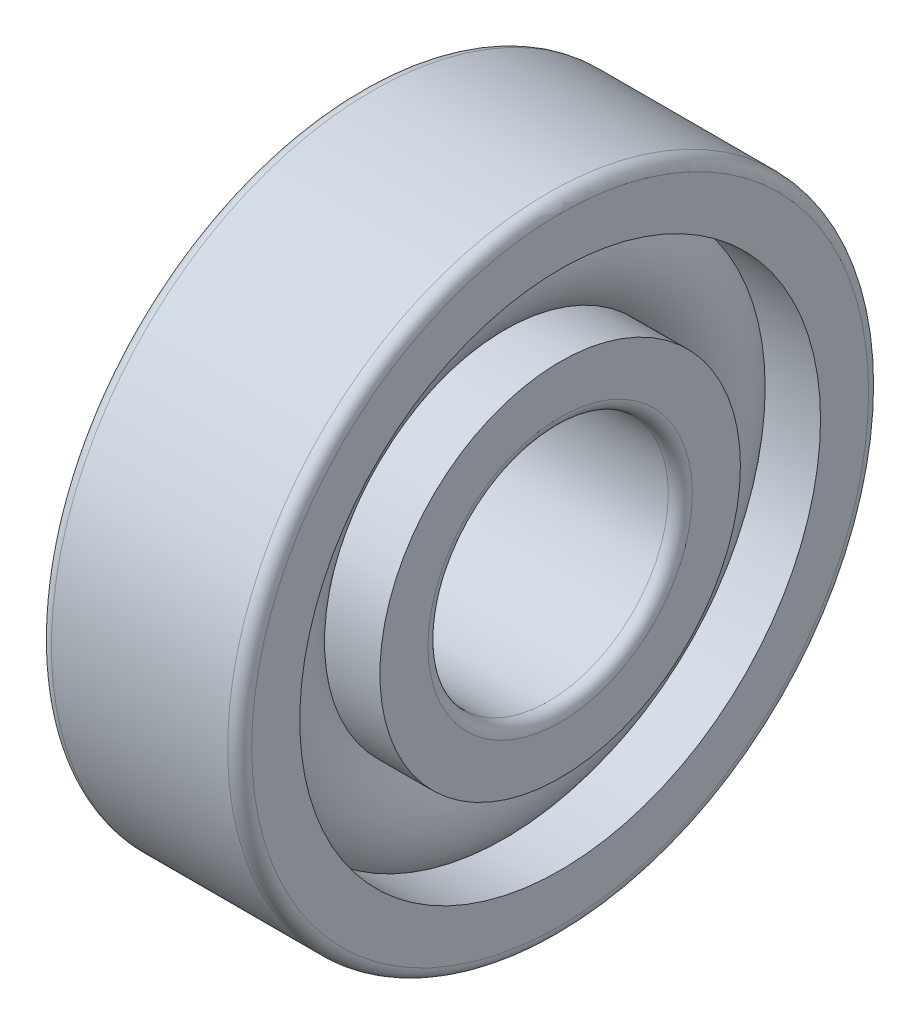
ISO-10303-21;
HEADER;
FILE_DESCRIPTION(('STEP AP214'),'2;1');
FILE_NAME('part.step','',(''),(''),'','','');
FILE_SCHEMA(('AUTOMOTIVE_DESIGN { 1 0 10303 214 1 1 1 1 }'));
ENDSEC;
DATA;
#1=APPLICATION_CONTEXT('core data for automotive mechanical design processes');
#2=APPLICATION_PROTOCOL_DEFINITION('international standard','automotive_design',2000,#1);
#3=PRODUCT_CONTEXT('',#1,'mechanical');
#4=PRODUCT('Part','Part','',(#3));
#5=PRODUCT_RELATED_PRODUCT_CATEGORY('part','',(#4));
#6=PRODUCT_DEFINITION_FORMATION('','',#4);
#7=PRODUCT_DEFINITION_CONTEXT('part definition',#1,'design');
#8=PRODUCT_DEFINITION('design','',#6,#7);
#9=PRODUCT_DEFINITION_SHAPE('','',#8);
#10=(LENGTH_UNIT() NAMED_UNIT(*) SI_UNIT(.MILLI.,.METRE.));
#11=(NAMED_UNIT(*) PLANE_ANGLE_UNIT() SI_UNIT($,.RADIAN.));
#12=(NAMED_UNIT(*) SI_UNIT($,.STERADIAN.) SOLID_ANGLE_UNIT());
#13=UNCERTAINTY_MEASURE_WITH_UNIT(LENGTH_MEASURE(1.E-05),#10,'distance_accuracy_value','');
#14=(GEOMETRIC_REPRESENTATION_CONTEXT(3) GLOBAL_UNCERTAINTY_ASSIGNED_CONTEXT((#13)) GLOBAL_UNIT_ASSIGNED_CONTEXT((#10,
#11,#12)) REPRESENTATION_CONTEXT('',''));
#15=CARTESIAN_POINT('',(0.,0.,0.));
#16=DIRECTION('',(0.,0.,1.));
#17=DIRECTION('',(1.,0.,0.));
#18=AXIS2_PLACEMENT_3D('',#15,#16,#17);
#19=CARTESIAN_POINT('',(0.,0.,0.));
#20=DIRECTION('',(-0.999999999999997,0.,0.));
#21=DIRECTION('',(0.,0.,1.));
#22=AXIS2_PLACEMENT_3D('',#19,#20,#21);
#23=TOROIDAL_SURFACE('',#22,11.,3.);
#24=CARTESIAN_POINT('',(2.23606797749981,0.,0.));
#25=DIRECTION('',(-0.999999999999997,0.,0.));
#26=DIRECTION('',(0.,0.,1.));
#27=AXIS2_PLACEMENT_3D('',#24,#25,#26);
#28=CIRCLE('',#27,13.);
#29=CARTESIAN_POINT('',(2.23606797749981,0.,-13.0000000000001));
#30=VERTEX_POINT('',#29);
#31=EDGE_CURVE('E38',#30,#30,#28,.F.);
#32=ORIENTED_EDGE('',*,*,#31,.T.);
#33=EDGE_LOOP('',(#32));
#34=FACE_BOUND('',#33,.T.);
#35=CARTESIAN_POINT('',(2.23606797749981,0.,0.));
#36=DIRECTION('',(-0.999999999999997,0.,0.));
#37=DIRECTION('',(0.,0.,1.));
#38=AXIS2_PLACEMENT_3D('',#35,#36,#37);
#39=CIRCLE('',#38,9.);
#40=CARTESIAN_POINT('',(2.23606797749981,0.,-9.00000000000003));
#41=VERTEX_POINT('',#40);
#42=EDGE_CURVE('E10',#41,#41,#39,.T.);
#43=ORIENTED_EDGE('',*,*,#42,.T.);
#44=EDGE_LOOP('',(#43));
#45=FACE_BOUND('',#44,.T.);
#46=ADVANCED_FACE('F34',(#34,#45),#23,.T.);
#47=CARTESIAN_POINT('',(-20.6375,0.,0.));
#48=DIRECTION('',(0.999999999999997,0.,0.));
#49=DIRECTION('',(0.,0.,-1.));
#50=AXIS2_PLACEMENT_3D('',#47,#48,#49);
#51=CYLINDRICAL_SURFACE('',#50,9.);
#52=CARTESIAN_POINT('',(5.,0.,0.));
#53=DIRECTION('',(0.999999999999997,0.,0.));
#54=DIRECTION('',(0.,0.,-1.));
#55=AXIS2_PLACEMENT_3D('',#52,#53,#54);
#56=CIRCLE('',#55,9.);
#57=CARTESIAN_POINT('',(5.,0.,-9.00000000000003));
#58=VERTEX_POINT('',#57);
#59=EDGE_CURVE('E51',#58,#58,#56,.T.);
#60=CARTESIAN_POINT('',(5.,0.,-9.00000000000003));
#61=CARTESIAN_POINT('',(4.97120904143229,0.,-9.00000000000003));
#62=CARTESIAN_POINT('',(4.94241808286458,0.,-9.00000000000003));
#63=CARTESIAN_POINT('',(4.88483616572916,0.,-9.00000000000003));
#64=CARTESIAN_POINT('',(4.85604520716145,0.,-9.00000000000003));
#65=CARTESIAN_POINT('',(4.79846329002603,0.,-9.00000000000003));
#66=CARTESIAN_POINT('',(4.76967233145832,0.,-9.00000000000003));
#67=CARTESIAN_POINT('',(4.7120904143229,0.,-9.00000000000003));
#68=CARTESIAN_POINT('',(4.68329945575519,0.,-9.00000000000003));
#69=CARTESIAN_POINT('',(4.62571753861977,0.,-9.00000000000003));
#70=CARTESIAN_POINT('',(4.59692658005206,0.,-9.00000000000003));
#71=CARTESIAN_POINT('',(4.53934466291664,0.,-9.00000000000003));
#72=CARTESIAN_POINT('',(4.51055370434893,0.,-9.00000000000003));
#73=CARTESIAN_POINT('',(4.45297178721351,0.,-9.00000000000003));
#74=CARTESIAN_POINT('',(4.4241808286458,0.,-9.00000000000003));
#75=CARTESIAN_POINT('',(4.36659891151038,0.,-9.00000000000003));
#76=CARTESIAN_POINT('',(4.33780795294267,0.,-9.00000000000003));
#77=CARTESIAN_POINT('',(4.28022603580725,0.,-9.00000000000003));
#78=CARTESIAN_POINT('',(4.25143507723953,0.,-9.00000000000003));
#79=CARTESIAN_POINT('',(4.19385316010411,0.,-9.00000000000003));
#80=CARTESIAN_POINT('',(4.1650622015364,0.,-9.00000000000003));
#81=CARTESIAN_POINT('',(4.10748028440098,0.,-9.00000000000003));
#82=CARTESIAN_POINT('',(4.07868932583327,0.,-9.00000000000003));
#83=CARTESIAN_POINT('',(4.02110740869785,0.,-9.00000000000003));
#84=CARTESIAN_POINT('',(3.99231645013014,0.,-9.00000000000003));
#85=CARTESIAN_POINT('',(3.93473453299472,0.,-9.00000000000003));
#86=CARTESIAN_POINT('',(3.90594357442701,0.,-9.00000000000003));
#87=CARTESIAN_POINT('',(3.84836165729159,0.,-9.00000000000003));
#88=CARTESIAN_POINT('',(3.81957069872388,0.,-9.00000000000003));
#89=CARTESIAN_POINT('',(3.76198878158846,0.,-9.00000000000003));
#90=CARTESIAN_POINT('',(3.73319782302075,0.,-9.00000000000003));
#91=CARTESIAN_POINT('',(3.67561590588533,0.,-9.00000000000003));
#92=CARTESIAN_POINT('',(3.64682494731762,0.,-9.00000000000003));
#93=CARTESIAN_POINT('',(3.5892430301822,0.,-9.00000000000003));
#94=CARTESIAN_POINT('',(3.56045207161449,0.,-9.00000000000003));
#95=CARTESIAN_POINT('',(3.50287015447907,0.,-9.00000000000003));
#96=CARTESIAN_POINT('',(3.47407919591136,0.,-9.00000000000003));
#97=CARTESIAN_POINT('',(3.41649727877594,0.,-9.00000000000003));
#98=CARTESIAN_POINT('',(3.38770632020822,0.,-9.00000000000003));
#99=CARTESIAN_POINT('',(3.3301244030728,0.,-9.00000000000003));
#100=CARTESIAN_POINT('',(3.30133344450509,0.,-9.00000000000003));
#101=CARTESIAN_POINT('',(3.24375152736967,0.,-9.00000000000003));
#102=CARTESIAN_POINT('',(3.21496056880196,0.,-9.00000000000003));
#103=CARTESIAN_POINT('',(3.15737865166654,0.,-9.00000000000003));
#104=CARTESIAN_POINT('',(3.12858769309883,0.,-9.00000000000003));
#105=CARTESIAN_POINT('',(3.07100577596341,0.,-9.00000000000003));
#106=CARTESIAN_POINT('',(3.0422148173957,0.,-9.00000000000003));
#107=CARTESIAN_POINT('',(2.98463290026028,0.,-9.00000000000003));
#108=CARTESIAN_POINT('',(2.95584194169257,0.,-9.00000000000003));
#109=CARTESIAN_POINT('',(2.89826002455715,0.,-9.00000000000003));
#110=CARTESIAN_POINT('',(2.86946906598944,0.,-9.00000000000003));
#111=CARTESIAN_POINT('',(2.81188714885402,0.,-9.00000000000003));
#112=CARTESIAN_POINT('',(2.78309619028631,0.,-9.00000000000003));
#113=CARTESIAN_POINT('',(2.72551427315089,0.,-9.00000000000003));
#114=CARTESIAN_POINT('',(2.69672331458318,0.,-9.00000000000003));
#115=CARTESIAN_POINT('',(2.63914139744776,0.,-9.00000000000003));
#116=CARTESIAN_POINT('',(2.61035043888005,0.,-9.00000000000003));
#117=CARTESIAN_POINT('',(2.55276852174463,0.,-9.00000000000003));
#118=CARTESIAN_POINT('',(2.52397756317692,0.,-9.00000000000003));
#119=CARTESIAN_POINT('',(2.4663956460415,0.,-9.00000000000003));
#120=CARTESIAN_POINT('',(2.43760468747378,0.,-9.00000000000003));
#121=CARTESIAN_POINT('',(2.38002277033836,0.,-9.00000000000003));
#122=CARTESIAN_POINT('',(2.35123181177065,0.,-9.00000000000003));
#123=CARTESIAN_POINT('',(2.29364989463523,0.,-9.00000000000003));
#124=CARTESIAN_POINT('',(2.26485893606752,0.,-9.00000000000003));
#125=CARTESIAN_POINT('',(2.23606797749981,0.,-9.00000000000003));
#126=B_SPLINE_CURVE_WITH_KNOTS('',3,(#60,#61,#62,#63,#64,#65,#66,#67,#68,#69,#70,#71,#72,#73,
#74,#75,#76,#77,#78,#79,#80,#81,#82,#83,#84,#85,#86,#87,#88,#89,#90,#91,#92,#93,#94,#95,#96,#97,
#98,#99,#100,#101,#102,#103,#104,#105,#106,#107,#108,#109,#110,#111,#112,#113,#114,#115,#116,
#117,#118,#119,#120,#121,#122,#123,#124,#125),.UNSPECIFIED.,.F.,.F.,(4,2,2,2,2,2,2,2,2,2,2,2,2,
2,2,2,2,2,2,2,2,2,2,2,2,2,2,2,2,2,2,2,4),(0.,0.0863728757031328,0.172745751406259,
0.259118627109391,0.345491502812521,0.431864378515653,0.518237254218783,0.604610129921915,
0.690983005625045,0.777355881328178,0.86372875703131,0.95010163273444,1.03647450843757,
1.1228473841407,1.20922025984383,1.29559313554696,1.38196601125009,1.46833888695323,
1.55471176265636,1.64108463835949,1.72745751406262,1.81383038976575,1.90020326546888,
1.98657614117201,2.07294901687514,2.15932189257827,2.2456947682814,2.33206764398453,
2.41844051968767,2.50481339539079,2.59118627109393,2.67755914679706,2.76393202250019),.UNSPECIFIED.);
#127=EDGE_CURVE('BSEAM100',#58,#41,#126,.T.);
#128=ORIENTED_EDGE('',*,*,#59,.F.);
#129=ORIENTED_EDGE('',*,*,#42,.F.);
#130=ORIENTED_EDGE('',*,*,#127,.T.);
#131=ORIENTED_EDGE('',*,*,#127,.F.);
#132=EDGE_LOOP('',(#128,#130,#129,#131));
#133=FACE_BOUND('',#132,.T.);
#134=ADVANCED_FACE('F100',(#133),#51,.T.);
#135=CARTESIAN_POINT('',(-20.6375,0.,0.));
#136=DIRECTION('',(0.999999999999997,0.,0.));
#137=DIRECTION('',(0.,0.,-1.));
#138=AXIS2_PLACEMENT_3D('',#135,#136,#137);
#139=CYLINDRICAL_SURFACE('',#138,9.);
#140=CARTESIAN_POINT('',(-5.,0.,0.));
#141=DIRECTION('',(0.999999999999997,0.,0.));
#142=DIRECTION('',(0.,0.,-1.));
#143=AXIS2_PLACEMENT_3D('',#140,#141,#142);
#144=CIRCLE('',#143,9.);
#145=CARTESIAN_POINT('',(-5.00000000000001,0.,-9.00000000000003));
#146=VERTEX_POINT('',#145);
#147=EDGE_CURVE('E64',#146,#146,#144,.T.);
#148=CARTESIAN_POINT('',(-2.23606797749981,0.,0.));
#149=DIRECTION('',(0.999999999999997,0.,0.));
#150=DIRECTION('',(0.,0.,-1.));
#151=AXIS2_PLACEMENT_3D('',#148,#149,#150);
#152=CIRCLE('',#151,9.);
#153=CARTESIAN_POINT('',(-2.23606797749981,0.,-9.00000000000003));
#154=VERTEX_POINT('',#153);
#155=EDGE_CURVE('E43',#154,#154,#152,.T.);
#156=CARTESIAN_POINT('',(-5.00000000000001,0.,-9.00000000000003));
#157=CARTESIAN_POINT('',(-4.9712090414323,0.,-9.00000000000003));
#158=CARTESIAN_POINT('',(-4.94241808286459,0.,-9.00000000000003));
#159=CARTESIAN_POINT('',(-4.88483616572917,0.,-9.00000000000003));
#160=CARTESIAN_POINT('',(-4.85604520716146,0.,-9.00000000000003));
#161=CARTESIAN_POINT('',(-4.79846329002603,0.,-9.00000000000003));
#162=CARTESIAN_POINT('',(-4.76967233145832,0.,-9.00000000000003));
#163=CARTESIAN_POINT('',(-4.7120904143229,0.,-9.00000000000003));
#164=CARTESIAN_POINT('',(-4.68329945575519,0.,-9.00000000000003));
#165=CARTESIAN_POINT('',(-4.62571753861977,0.,-9.00000000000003));
#166=CARTESIAN_POINT('',(-4.59692658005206,0.,-9.00000000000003));
#167=CARTESIAN_POINT('',(-4.53934466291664,0.,-9.00000000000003));
#168=CARTESIAN_POINT('',(-4.51055370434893,0.,-9.00000000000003));
#169=CARTESIAN_POINT('',(-4.45297178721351,0.,-9.00000000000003));
#170=CARTESIAN_POINT('',(-4.4241808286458,0.,-9.00000000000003));
#171=CARTESIAN_POINT('',(-4.36659891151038,0.,-9.00000000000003));
#172=CARTESIAN_POINT('',(-4.33780795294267,0.,-9.00000000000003));
#173=CARTESIAN_POINT('',(-4.28022603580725,0.,-9.00000000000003));
#174=CARTESIAN_POINT('',(-4.25143507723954,0.,-9.00000000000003));
#175=CARTESIAN_POINT('',(-4.19385316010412,0.,-9.00000000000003));
#176=CARTESIAN_POINT('',(-4.16506220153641,0.,-9.00000000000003));
#177=CARTESIAN_POINT('',(-4.10748028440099,0.,-9.00000000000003));
#178=CARTESIAN_POINT('',(-4.07868932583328,0.,-9.00000000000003));
#179=CARTESIAN_POINT('',(-4.02110740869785,0.,-9.00000000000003));
#180=CARTESIAN_POINT('',(-3.99231645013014,0.,-9.00000000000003));
#181=CARTESIAN_POINT('',(-3.93473453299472,0.,-9.00000000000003));
#182=CARTESIAN_POINT('',(-3.90594357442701,0.,-9.00000000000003));
#183=CARTESIAN_POINT('',(-3.84836165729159,0.,-9.00000000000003));
#184=CARTESIAN_POINT('',(-3.81957069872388,0.,-9.00000000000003));
#185=CARTESIAN_POINT('',(-3.76198878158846,0.,-9.00000000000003));
#186=CARTESIAN_POINT('',(-3.73319782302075,0.,-9.00000000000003));
#187=CARTESIAN_POINT('',(-3.67561590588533,0.,-9.00000000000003));
#188=CARTESIAN_POINT('',(-3.64682494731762,0.,-9.00000000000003));
#189=CARTESIAN_POINT('',(-3.5892430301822,0.,-9.00000000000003));
#190=CARTESIAN_POINT('',(-3.56045207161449,0.,-9.00000000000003));
#191=CARTESIAN_POINT('',(-3.50287015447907,0.,-9.00000000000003));
#192=CARTESIAN_POINT('',(-3.47407919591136,0.,-9.00000000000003));
#193=CARTESIAN_POINT('',(-3.41649727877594,0.,-9.00000000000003));
#194=CARTESIAN_POINT('',(-3.38770632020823,0.,-9.00000000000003));
#195=CARTESIAN_POINT('',(-3.33012440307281,0.,-9.00000000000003));
#196=CARTESIAN_POINT('',(-3.3013334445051,0.,-9.00000000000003));
#197=CARTESIAN_POINT('',(-3.24375152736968,0.,-9.00000000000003));
#198=CARTESIAN_POINT('',(-3.21496056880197,0.,-9.00000000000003));
#199=CARTESIAN_POINT('',(-3.15737865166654,0.,-9.00000000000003));
#200=CARTESIAN_POINT('',(-3.12858769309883,0.,-9.00000000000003));
#201=CARTESIAN_POINT('',(-3.07100577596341,0.,-9.00000000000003));
#202=CARTESIAN_POINT('',(-3.0422148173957,0.,-9.00000000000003));
#203=CARTESIAN_POINT('',(-2.98463290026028,0.,-9.00000000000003));
#204=CARTESIAN_POINT('',(-2.95584194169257,0.,-9.00000000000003));
#205=CARTESIAN_POINT('',(-2.89826002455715,0.,-9.00000000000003));
#206=CARTESIAN_POINT('',(-2.86946906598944,0.,-9.00000000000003));
#207=CARTESIAN_POINT('',(-2.81188714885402,0.,-9.00000000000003));
#208=CARTESIAN_POINT('',(-2.78309619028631,0.,-9.00000000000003));
#209=CARTESIAN_POINT('',(-2.72551427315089,0.,-9.00000000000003));
#210=CARTESIAN_POINT('',(-2.69672331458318,0.,-9.00000000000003));
#211=CARTESIAN_POINT('',(-2.63914139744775,0.,-9.00000000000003));
#212=CARTESIAN_POINT('',(-2.61035043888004,0.,-9.00000000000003));
#213=CARTESIAN_POINT('',(-2.55276852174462,0.,-9.00000000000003));
#214=CARTESIAN_POINT('',(-2.52397756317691,0.,-9.00000000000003));
#215=CARTESIAN_POINT('',(-2.46639564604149,0.,-9.00000000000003));
#216=CARTESIAN_POINT('',(-2.43760468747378,0.,-9.00000000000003));
#217=CARTESIAN_POINT('',(-2.38002277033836,0.,-9.00000000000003));
#218=CARTESIAN_POINT('',(-2.35123181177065,0.,-9.00000000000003));
#219=CARTESIAN_POINT('',(-2.29364989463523,0.,-9.00000000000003));
#220=CARTESIAN_POINT('',(-2.26485893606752,0.,-9.00000000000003));
#221=CARTESIAN_POINT('',(-2.23606797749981,0.,-9.00000000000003));
#222=B_SPLINE_CURVE_WITH_KNOTS('',3,(#156,#157,#158,#159,#160,#161,#162,#163,#164,#165,#166,
#167,#168,#169,#170,#171,#172,#173,#174,#175,#176,#177,#178,#179,#180,#181,#182,#183,#184,#185,
#186,#187,#188,#189,#190,#191,#192,#193,#194,#195,#196,#197,#198,#199,#200,#201,#202,#203,#204,
#205,#206,#207,#208,#209,#210,#211,#212,#213,#214,#215,#216,#217,#218,#219,#220,#221),
.UNSPECIFIED.,.F.,.F.,(4,2,2,2,2,2,2,2,2,2,2,2,2,2,2,2,2,2,2,2,2,2,2,2,2,2,2,2,2,2,2,2,4),(0.,
0.0863728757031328,0.172745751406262,0.259118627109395,0.345491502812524,0.431864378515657,
0.518237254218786,0.604610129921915,0.690983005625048,0.777355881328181,0.86372875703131,
0.950101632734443,1.03647450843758,1.12284738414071,1.20922025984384,1.29559313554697,
1.3819660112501,1.46833888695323,1.55471176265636,1.64108463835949,1.72745751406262,
1.81383038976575,1.90020326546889,1.98657614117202,2.07294901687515,2.15932189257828,
2.24569476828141,2.33206764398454,2.41844051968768,2.5048133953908,2.59118627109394,
2.67755914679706,2.7639320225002),.UNSPECIFIED.);
#223=EDGE_CURVE('BSEAM103',#146,#154,#222,.T.);
#224=ORIENTED_EDGE('',*,*,#147,.T.);
#225=ORIENTED_EDGE('',*,*,#155,.F.);
#226=ORIENTED_EDGE('',*,*,#223,.T.);
#227=ORIENTED_EDGE('',*,*,#223,.F.);
#228=EDGE_LOOP('',(#224,#226,#225,#227));
#229=FACE_BOUND('',#228,.T.);
#230=ADVANCED_FACE('F103',(#229),#139,.T.);
#231=CARTESIAN_POINT('',(5.,6.59999999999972,0.));
#232=DIRECTION('',(0.999999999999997,0.,0.));
#233=DIRECTION('',(0.,0.,-1.));
#234=AXIS2_PLACEMENT_3D('',#231,#232,#233);
#235=PLANE('',#234);
#236=ORIENTED_EDGE('',*,*,#59,.T.);
#237=EDGE_LOOP('',(#236));
#238=FACE_BOUND('',#237,.T.);
#239=CARTESIAN_POINT('',(5.,0.,0.));
#240=DIRECTION('',(0.999999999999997,0.,0.));
#241=DIRECTION('',(0.,0.,-1.));
#242=AXIS2_PLACEMENT_3D('',#239,#240,#241);
#243=CIRCLE('',#242,6.6);
#244=CARTESIAN_POINT('',(5.,0.,-6.60000000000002));
#245=VERTEX_POINT('',#244);
#246=EDGE_CURVE('E89',#245,#245,#243,.T.);
#247=ORIENTED_EDGE('',*,*,#246,.F.);
#248=EDGE_LOOP('',(#247));
#249=FACE_BOUND('',#248,.T.);
#250=ADVANCED_FACE('F97',(#238,#249),#235,.T.);
#251=CARTESIAN_POINT('',(4.40000000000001,0.,0.));
#252=DIRECTION('',(0.999999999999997,0.,0.));
#253=DIRECTION('',(0.,0.,-1.));
#254=AXIS2_PLACEMENT_3D('',#251,#252,#253);
#255=TOROIDAL_SURFACE('',#254,6.6,0.600000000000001);
#256=ORIENTED_EDGE('',*,*,#246,.T.);
#257=EDGE_LOOP('',(#256));
#258=FACE_BOUND('',#257,.T.);
#259=CARTESIAN_POINT('',(4.40000000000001,0.,0.));
#260=DIRECTION('',(0.999999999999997,0.,0.));
#261=DIRECTION('',(0.,0.,-1.));
#262=AXIS2_PLACEMENT_3D('',#259,#260,#261);
#263=CIRCLE('',#262,6.);
#264=CARTESIAN_POINT('',(4.40000000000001,0.,-6.00000000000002));
#265=VERTEX_POINT('',#264);
#266=EDGE_CURVE('E85',#265,#265,#263,.T.);
#267=ORIENTED_EDGE('',*,*,#266,.F.);
#268=EDGE_LOOP('',(#267));
#269=FACE_BOUND('',#268,.T.);
#270=ADVANCED_FACE('F114',(#258,#269),#255,.T.);
#271=CARTESIAN_POINT('',(-20.6375,0.,0.));
#272=DIRECTION('',(0.999999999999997,0.,0.));
#273=DIRECTION('',(0.,0.,-1.));
#274=AXIS2_PLACEMENT_3D('',#271,#272,#273);
#275=CYLINDRICAL_SURFACE('',#274,6.);
#276=CARTESIAN_POINT('',(-4.40000000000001,0.,0.));
#277=DIRECTION('',(0.999999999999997,0.,0.));
#278=DIRECTION('',(0.,0.,-1.));
#279=AXIS2_PLACEMENT_3D('',#276,#277,#278);
#280=CIRCLE('',#279,6.);
#281=CARTESIAN_POINT('',(-4.40000000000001,0.,-6.00000000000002));
#282=VERTEX_POINT('',#281);
#283=EDGE_CURVE('E82',#282,#282,#280,.T.);
#284=CARTESIAN_POINT('',(4.40000000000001,0.,-6.00000000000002));
#285=CARTESIAN_POINT('',(4.30833333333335,0.,-6.00000000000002));
#286=CARTESIAN_POINT('',(4.21666666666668,0.,-6.00000000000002));
#287=CARTESIAN_POINT('',(4.03333333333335,0.,-6.00000000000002));
#288=CARTESIAN_POINT('',(3.94166666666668,0.,-6.00000000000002));
#289=CARTESIAN_POINT('',(3.75833333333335,0.,-6.00000000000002));
#290=CARTESIAN_POINT('',(3.66666666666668,0.,-6.00000000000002));
#291=CARTESIAN_POINT('',(3.48333333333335,0.,-6.00000000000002));
#292=CARTESIAN_POINT('',(3.39166666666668,0.,-6.00000000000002));
#293=CARTESIAN_POINT('',(3.20833333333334,0.,-6.00000000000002));
#294=CARTESIAN_POINT('',(3.11666666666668,0.,-6.00000000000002));
#295=CARTESIAN_POINT('',(2.93333333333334,0.,-6.00000000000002));
#296=CARTESIAN_POINT('',(2.84166666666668,0.,-6.00000000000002));
#297=CARTESIAN_POINT('',(2.65833333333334,0.,-6.00000000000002));
#298=CARTESIAN_POINT('',(2.56666666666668,0.,-6.00000000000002));
#299=CARTESIAN_POINT('',(2.38333333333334,0.,-6.00000000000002));
#300=CARTESIAN_POINT('',(2.29166666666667,0.,-6.00000000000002));
#301=CARTESIAN_POINT('',(2.10833333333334,0.,-6.00000000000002));
#302=CARTESIAN_POINT('',(2.01666666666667,0.,-6.00000000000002));
#303=CARTESIAN_POINT('',(1.83333333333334,0.,-6.00000000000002));
#304=CARTESIAN_POINT('',(1.74166666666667,0.,-6.00000000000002));
#305=CARTESIAN_POINT('',(1.55833333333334,0.,-6.00000000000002));
#306=CARTESIAN_POINT('',(1.46666666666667,0.,-6.00000000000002));
#307=CARTESIAN_POINT('',(1.28333333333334,0.,-6.00000000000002));
#308=CARTESIAN_POINT('',(1.19166666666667,0.,-6.00000000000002));
#309=CARTESIAN_POINT('',(1.00833333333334,0.,-6.00000000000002));
#310=CARTESIAN_POINT('',(0.91666666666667,0.,-6.00000000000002));
#311=CARTESIAN_POINT('',(0.733333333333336,0.,-6.00000000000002));
#312=CARTESIAN_POINT('',(0.641666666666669,0.,-6.00000000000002));
#313=CARTESIAN_POINT('',(0.458333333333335,0.,-6.00000000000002));
#314=CARTESIAN_POINT('',(0.366666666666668,0.,-6.00000000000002));
#315=CARTESIAN_POINT('',(0.183333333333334,0.,-6.00000000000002));
#316=CARTESIAN_POINT('',(0.091666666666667,0.,-6.00000000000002));
#317=CARTESIAN_POINT('',(-0.091666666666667,0.,-6.00000000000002));
#318=CARTESIAN_POINT('',(-0.183333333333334,0.,-6.00000000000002));
#319=CARTESIAN_POINT('',(-0.366666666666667,0.,-6.00000000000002));
#320=CARTESIAN_POINT('',(-0.458333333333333,0.,-6.00000000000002));
#321=CARTESIAN_POINT('',(-0.641666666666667,0.,-6.00000000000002));
#322=CARTESIAN_POINT('',(-0.733333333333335,0.,-6.00000000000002));
#323=CARTESIAN_POINT('',(-0.91666666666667,0.,-6.00000000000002));
#324=CARTESIAN_POINT('',(-1.00833333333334,0.,-6.00000000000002));
#325=CARTESIAN_POINT('',(-1.19166666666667,0.,-6.00000000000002));
#326=CARTESIAN_POINT('',(-1.28333333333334,0.,-6.00000000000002));
#327=CARTESIAN_POINT('',(-1.46666666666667,0.,-6.00000000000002));
#328=CARTESIAN_POINT('',(-1.55833333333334,0.,-6.00000000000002));
#329=CARTESIAN_POINT('',(-1.74166666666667,0.,-6.00000000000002));
#330=CARTESIAN_POINT('',(-1.83333333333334,0.,-6.00000000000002));
#331=CARTESIAN_POINT('',(-2.01666666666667,0.,-6.00000000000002));
#332=CARTESIAN_POINT('',(-2.10833333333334,0.,-6.00000000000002));
#333=CARTESIAN_POINT('',(-2.29166666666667,0.,-6.00000000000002));
#334=CARTESIAN_POINT('',(-2.38333333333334,0.,-6.00000000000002));
#335=CARTESIAN_POINT('',(-2.56666666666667,0.,-6.00000000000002));
#336=CARTESIAN_POINT('',(-2.65833333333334,0.,-6.00000000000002));
#337=CARTESIAN_POINT('',(-2.84166666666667,0.,-6.00000000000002));
#338=CARTESIAN_POINT('',(-2.93333333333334,0.,-6.00000000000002));
#339=CARTESIAN_POINT('',(-3.11666666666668,0.,-6.00000000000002));
#340=CARTESIAN_POINT('',(-3.20833333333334,0.,-6.00000000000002));
#341=CARTESIAN_POINT('',(-3.39166666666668,0.,-6.00000000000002));
#342=CARTESIAN_POINT('',(-3.48333333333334,0.,-6.00000000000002));
#343=CARTESIAN_POINT('',(-3.66666666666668,0.,-6.00000000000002));
#344=CARTESIAN_POINT('',(-3.75833333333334,0.,-6.00000000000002));
#345=CARTESIAN_POINT('',(-3.94166666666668,0.,-6.00000000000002));
#346=CARTESIAN_POINT('',(-4.03333333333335,0.,-6.00000000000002));
#347=CARTESIAN_POINT('',(-4.21666666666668,0.,-6.00000000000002));
#348=CARTESIAN_POINT('',(-4.30833333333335,0.,-6.00000000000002));
#349=CARTESIAN_POINT('',(-4.40000000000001,0.,-6.00000000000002));
#350=B_SPLINE_CURVE_WITH_KNOTS('',3,(#284,#285,#286,#287,#288,#289,#290,#291,#292,#293,#294,
#295,#296,#297,#298,#299,#300,#301,#302,#303,#304,#305,#306,#307,#308,#309,#310,#311,#312,#313,
#314,#315,#316,#317,#318,#319,#320,#321,#322,#323,#324,#325,#326,#327,#328,#329,#330,#331,#332,
#333,#334,#335,#336,#337,#338,#339,#340,#341,#342,#343,#344,#345,#346,#347,#348,#349),
.UNSPECIFIED.,.F.,.F.,(4,2,2,2,2,2,2,2,2,2,2,2,2,2,2,2,2,2,2,2,2,2,2,2,2,2,2,2,2,2,2,2,4),(0.,
0.275000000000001,0.550000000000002,0.825000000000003,1.1,1.375,1.65000000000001,
1.92500000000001,2.20000000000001,2.47500000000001,2.75000000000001,3.02500000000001,
3.30000000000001,3.57500000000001,3.85000000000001,4.12500000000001,4.40000000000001,
4.67500000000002,4.95000000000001,5.22500000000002,5.50000000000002,5.77500000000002,
6.05000000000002,6.32500000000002,6.60000000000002,6.87500000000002,7.15000000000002,
7.42500000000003,7.70000000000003,7.97500000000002,8.25000000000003,8.52500000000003,
8.80000000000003),.UNSPECIFIED.);
#351=EDGE_CURVE('BSEAM117',#265,#282,#350,.T.);
#352=ORIENTED_EDGE('',*,*,#266,.T.);
#353=ORIENTED_EDGE('',*,*,#283,.F.);
#354=ORIENTED_EDGE('',*,*,#351,.T.);
#355=ORIENTED_EDGE('',*,*,#351,.F.);
#356=EDGE_LOOP('',(#352,#354,#353,#355));
#357=FACE_BOUND('',#356,.T.);
#358=ADVANCED_FACE('F117',(#357),#275,.F.);
#359=CARTESIAN_POINT('',(-4.40000000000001,0.,0.));
#360=DIRECTION('',(0.999999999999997,0.,0.));
#361=DIRECTION('',(0.,0.,-1.));
#362=AXIS2_PLACEMENT_3D('',#359,#360,#361);
#363=TOROIDAL_SURFACE('',#362,6.6,0.600000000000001);
#364=ORIENTED_EDGE('',*,*,#283,.T.);
#365=EDGE_LOOP('',(#364));
#366=FACE_BOUND('',#365,.T.);
#367=CARTESIAN_POINT('',(-5.,0.,0.));
#368=DIRECTION('',(0.999999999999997,0.,0.));
#369=DIRECTION('',(0.,0.,-1.));
#370=AXIS2_PLACEMENT_3D('',#367,#368,#369);
#371=CIRCLE('',#370,6.6);
#372=CARTESIAN_POINT('',(-5.,0.,-6.60000000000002));
#373=VERTEX_POINT('',#372);
#374=EDGE_CURVE('E78',#373,#373,#371,.T.);
#375=ORIENTED_EDGE('',*,*,#374,.F.);
#376=EDGE_LOOP('',(#375));
#377=FACE_BOUND('',#376,.T.);
#378=ADVANCED_FACE('F121',(#366,#377),#363,.T.);
#379=CARTESIAN_POINT('',(-4.99999999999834,8.99999999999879,-4.44089209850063E-13));
#380=DIRECTION('',(-0.999999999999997,0.,0.));
#381=DIRECTION('',(0.,0.,1.));
#382=AXIS2_PLACEMENT_3D('',#379,#380,#381);
#383=PLANE('',#382);
#384=ORIENTED_EDGE('',*,*,#374,.T.);
#385=EDGE_LOOP('',(#384));
#386=FACE_BOUND('',#385,.T.);
#387=ORIENTED_EDGE('',*,*,#147,.F.);
#388=EDGE_LOOP('',(#387));
#389=FACE_BOUND('',#388,.T.);
#390=ADVANCED_FACE('F125',(#386,#389),#383,.T.);
#391=CARTESIAN_POINT('',(-2.23606797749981,0.,0.));
#392=DIRECTION('',(0.999999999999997,0.,0.));
#393=DIRECTION('',(0.,0.,-1.));
#394=AXIS2_PLACEMENT_3D('',#391,#392,#393);
#395=CIRCLE('',#394,13.);
#396=CARTESIAN_POINT('',(-2.23606797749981,0.,-13.0000000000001));
#397=VERTEX_POINT('',#396);
#398=EDGE_CURVE('E54',#397,#397,#395,.F.);
#399=ORIENTED_EDGE('',*,*,#398,.T.);
#400=EDGE_LOOP('',(#399));
#401=FACE_BOUND('',#400,.T.);
#402=ORIENTED_EDGE('',*,*,#155,.T.);
#403=EDGE_LOOP('',(#402));
#404=FACE_BOUND('',#403,.T.);
#405=ADVANCED_FACE('F36',(#401,#404),#23,.T.);
#406=CARTESIAN_POINT('',(-20.6375,0.,0.));
#407=DIRECTION('',(0.999999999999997,0.,0.));
#408=DIRECTION('',(0.,0.,-1.));
#409=AXIS2_PLACEMENT_3D('',#406,#407,#408);
#410=CYLINDRICAL_SURFACE('',#409,13.);
#411=CARTESIAN_POINT('',(5.,0.,0.));
#412=DIRECTION('',(0.999999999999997,0.,0.));
#413=DIRECTION('',(0.,0.,-1.));
#414=AXIS2_PLACEMENT_3D('',#411,#412,#413);
#415=CIRCLE('',#414,13.);
#416=CARTESIAN_POINT('',(5.,0.,-13.0000000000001));
#417=VERTEX_POINT('',#416);
#418=EDGE_CURVE('E57',#417,#417,#415,.T.);
#419=CARTESIAN_POINT('',(5.,0.,-13.0000000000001));
#420=CARTESIAN_POINT('',(4.97120904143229,0.,-13.0000000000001));
#421=CARTESIAN_POINT('',(4.94241808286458,0.,-13.0000000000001));
#422=CARTESIAN_POINT('',(4.88483616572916,0.,-13.0000000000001));
#423=CARTESIAN_POINT('',(4.85604520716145,0.,-13.0000000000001));
#424=CARTESIAN_POINT('',(4.79846329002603,0.,-13.0000000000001));
#425=CARTESIAN_POINT('',(4.76967233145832,0.,-13.0000000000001));
#426=CARTESIAN_POINT('',(4.7120904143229,0.,-13.0000000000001));
#427=CARTESIAN_POINT('',(4.68329945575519,0.,-13.0000000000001));
#428=CARTESIAN_POINT('',(4.62571753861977,0.,-13.0000000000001));
#429=CARTESIAN_POINT('',(4.59692658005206,0.,-13.0000000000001));
#430=CARTESIAN_POINT('',(4.53934466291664,0.,-13.0000000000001));
#431=CARTESIAN_POINT('',(4.51055370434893,0.,-13.0000000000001));
#432=CARTESIAN_POINT('',(4.45297178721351,0.,-13.0000000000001));
#433=CARTESIAN_POINT('',(4.4241808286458,0.,-13.0000000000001));
#434=CARTESIAN_POINT('',(4.36659891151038,0.,-13.0000000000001));
#435=CARTESIAN_POINT('',(4.33780795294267,0.,-13.0000000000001));
#436=CARTESIAN_POINT('',(4.28022603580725,0.,-13.0000000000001));
#437=CARTESIAN_POINT('',(4.25143507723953,0.,-13.0000000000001));
#438=CARTESIAN_POINT('',(4.19385316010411,0.,-13.0000000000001));
#439=CARTESIAN_POINT('',(4.1650622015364,0.,-13.0000000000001));
#440=CARTESIAN_POINT('',(4.10748028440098,0.,-13.0000000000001));
#441=CARTESIAN_POINT('',(4.07868932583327,0.,-13.0000000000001));
#442=CARTESIAN_POINT('',(4.02110740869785,0.,-13.0000000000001));
#443=CARTESIAN_POINT('',(3.99231645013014,0.,-13.0000000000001));
#444=CARTESIAN_POINT('',(3.93473453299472,0.,-13.0000000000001));
#445=CARTESIAN_POINT('',(3.90594357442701,0.,-13.0000000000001));
#446=CARTESIAN_POINT('',(3.84836165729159,0.,-13.0000000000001));
#447=CARTESIAN_POINT('',(3.81957069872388,0.,-13.0000000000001));
#448=CARTESIAN_POINT('',(3.76198878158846,0.,-13.0000000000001));
#449=CARTESIAN_POINT('',(3.73319782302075,0.,-13.0000000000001));
#450=CARTESIAN_POINT('',(3.67561590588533,0.,-13.0000000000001));
#451=CARTESIAN_POINT('',(3.64682494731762,0.,-13.0000000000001));
#452=CARTESIAN_POINT('',(3.5892430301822,0.,-13.0000000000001));
#453=CARTESIAN_POINT('',(3.56045207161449,0.,-13.0000000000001));
#454=CARTESIAN_POINT('',(3.50287015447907,0.,-13.0000000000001));
#455=CARTESIAN_POINT('',(3.47407919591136,0.,-13.0000000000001));
#456=CARTESIAN_POINT('',(3.41649727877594,0.,-13.0000000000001));
#457=CARTESIAN_POINT('',(3.38770632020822,0.,-13.0000000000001));
#458=CARTESIAN_POINT('',(3.3301244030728,0.,-13.0000000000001));
#459=CARTESIAN_POINT('',(3.30133344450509,0.,-13.0000000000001));
#460=CARTESIAN_POINT('',(3.24375152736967,0.,-13.0000000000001));
#461=CARTESIAN_POINT('',(3.21496056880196,0.,-13.0000000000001));
#462=CARTESIAN_POINT('',(3.15737865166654,0.,-13.0000000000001));
#463=CARTESIAN_POINT('',(3.12858769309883,0.,-13.0000000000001));
#464=CARTESIAN_POINT('',(3.07100577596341,0.,-13.0000000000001));
#465=CARTESIAN_POINT('',(3.0422148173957,0.,-13.0000000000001));
#466=CARTESIAN_POINT('',(2.98463290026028,0.,-13.0000000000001));
#467=CARTESIAN_POINT('',(2.95584194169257,0.,-13.0000000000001));
#468=CARTESIAN_POINT('',(2.89826002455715,0.,-13.0000000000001));
#469=CARTESIAN_POINT('',(2.86946906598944,0.,-13.0000000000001));
#470=CARTESIAN_POINT('',(2.81188714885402,0.,-13.0000000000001));
#471=CARTESIAN_POINT('',(2.78309619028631,0.,-13.0000000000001));
#472=CARTESIAN_POINT('',(2.72551427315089,0.,-13.0000000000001));
#473=CARTESIAN_POINT('',(2.69672331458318,0.,-13.0000000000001));
#474=CARTESIAN_POINT('',(2.63914139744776,0.,-13.0000000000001));
#475=CARTESIAN_POINT('',(2.61035043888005,0.,-13.0000000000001));
#476=CARTESIAN_POINT('',(2.55276852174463,0.,-13.0000000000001));
#477=CARTESIAN_POINT('',(2.52397756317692,0.,-13.0000000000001));
#478=CARTESIAN_POINT('',(2.4663956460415,0.,-13.0000000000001));
#479=CARTESIAN_POINT('',(2.43760468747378,0.,-13.0000000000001));
#480=CARTESIAN_POINT('',(2.38002277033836,0.,-13.0000000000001));
#481=CARTESIAN_POINT('',(2.35123181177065,0.,-13.0000000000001));
#482=CARTESIAN_POINT('',(2.29364989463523,0.,-13.0000000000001));
#483=CARTESIAN_POINT('',(2.26485893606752,0.,-13.0000000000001));
#484=CARTESIAN_POINT('',(2.23606797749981,0.,-13.0000000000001));
#485=B_SPLINE_CURVE_WITH_KNOTS('',3,(#419,#420,#421,#422,#423,#424,#425,#426,#427,#428,#429,
#430,#431,#432,#433,#434,#435,#436,#437,#438,#439,#440,#441,#442,#443,#444,#445,#446,#447,#448,
#449,#450,#451,#452,#453,#454,#455,#456,#457,#458,#459,#460,#461,#462,#463,#464,#465,#466,#467,
#468,#469,#470,#471,#472,#473,#474,#475,#476,#477,#478,#479,#480,#481,#482,#483,#484),
.UNSPECIFIED.,.F.,.F.,(4,2,2,2,2,2,2,2,2,2,2,2,2,2,2,2,2,2,2,2,2,2,2,2,2,2,2,2,2,2,2,2,4),(0.,
0.0863728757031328,0.172745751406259,0.259118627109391,0.345491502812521,0.431864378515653,
0.518237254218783,0.604610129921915,0.690983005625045,0.777355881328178,0.86372875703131,
0.95010163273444,1.03647450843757,1.1228473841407,1.20922025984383,1.29559313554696,
1.38196601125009,1.46833888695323,1.55471176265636,1.64108463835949,1.72745751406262,
1.81383038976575,1.90020326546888,1.98657614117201,2.07294901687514,2.15932189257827,
2.2456947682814,2.33206764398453,2.41844051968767,2.50481339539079,2.59118627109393,
2.67755914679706,2.76393202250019),.UNSPECIFIED.);
#486=EDGE_CURVE('BSEAM130',#417,#30,#485,.T.);
#487=ORIENTED_EDGE('',*,*,#418,.T.);
#488=ORIENTED_EDGE('',*,*,#31,.F.);
#489=ORIENTED_EDGE('',*,*,#486,.T.);
#490=ORIENTED_EDGE('',*,*,#486,.F.);
#491=EDGE_LOOP('',(#487,#489,#488,#490));
#492=FACE_BOUND('',#491,.T.);
#493=ADVANCED_FACE('F130',(#492),#410,.F.);
#494=CARTESIAN_POINT('',(-20.6375,0.,0.));
#495=DIRECTION('',(0.999999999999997,0.,0.));
#496=DIRECTION('',(0.,0.,-1.));
#497=AXIS2_PLACEMENT_3D('',#494,#495,#496);
#498=CYLINDRICAL_SURFACE('',#497,13.);
#499=CARTESIAN_POINT('',(-5.,0.,0.));
#500=DIRECTION('',(0.999999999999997,0.,0.));
#501=DIRECTION('',(0.,0.,-1.));
#502=AXIS2_PLACEMENT_3D('',#499,#500,#501);
#503=CIRCLE('',#502,13.);
#504=CARTESIAN_POINT('',(-5.00000000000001,0.,-13.0000000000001));
#505=VERTEX_POINT('',#504);
#506=EDGE_CURVE('E161',#505,#505,#503,.T.);
#507=CARTESIAN_POINT('',(-5.00000000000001,0.,-13.0000000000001));
#508=CARTESIAN_POINT('',(-4.9712090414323,0.,-13.0000000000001));
#509=CARTESIAN_POINT('',(-4.94241808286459,0.,-13.0000000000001));
#510=CARTESIAN_POINT('',(-4.88483616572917,0.,-13.0000000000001));
#511=CARTESIAN_POINT('',(-4.85604520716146,0.,-13.0000000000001));
#512=CARTESIAN_POINT('',(-4.79846329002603,0.,-13.0000000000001));
#513=CARTESIAN_POINT('',(-4.76967233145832,0.,-13.0000000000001));
#514=CARTESIAN_POINT('',(-4.7120904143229,0.,-13.0000000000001));
#515=CARTESIAN_POINT('',(-4.68329945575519,0.,-13.0000000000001));
#516=CARTESIAN_POINT('',(-4.62571753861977,0.,-13.0000000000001));
#517=CARTESIAN_POINT('',(-4.59692658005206,0.,-13.0000000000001));
#518=CARTESIAN_POINT('',(-4.53934466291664,0.,-13.0000000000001));
#519=CARTESIAN_POINT('',(-4.51055370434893,0.,-13.0000000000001));
#520=CARTESIAN_POINT('',(-4.45297178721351,0.,-13.0000000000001));
#521=CARTESIAN_POINT('',(-4.4241808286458,0.,-13.0000000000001));
#522=CARTESIAN_POINT('',(-4.36659891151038,0.,-13.0000000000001));
#523=CARTESIAN_POINT('',(-4.33780795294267,0.,-13.0000000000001));
#524=CARTESIAN_POINT('',(-4.28022603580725,0.,-13.0000000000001));
#525=CARTESIAN_POINT('',(-4.25143507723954,0.,-13.0000000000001));
#526=CARTESIAN_POINT('',(-4.19385316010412,0.,-13.0000000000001));
#527=CARTESIAN_POINT('',(-4.16506220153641,0.,-13.0000000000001));
#528=CARTESIAN_POINT('',(-4.10748028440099,0.,-13.0000000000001));
#529=CARTESIAN_POINT('',(-4.07868932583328,0.,-13.0000000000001));
#530=CARTESIAN_POINT('',(-4.02110740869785,0.,-13.0000000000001));
#531=CARTESIAN_POINT('',(-3.99231645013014,0.,-13.0000000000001));
#532=CARTESIAN_POINT('',(-3.93473453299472,0.,-13.0000000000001));
#533=CARTESIAN_POINT('',(-3.90594357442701,0.,-13.0000000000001));
#534=CARTESIAN_POINT('',(-3.84836165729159,0.,-13.0000000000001));
#535=CARTESIAN_POINT('',(-3.81957069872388,0.,-13.0000000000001));
#536=CARTESIAN_POINT('',(-3.76198878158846,0.,-13.0000000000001));
#537=CARTESIAN_POINT('',(-3.73319782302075,0.,-13.0000000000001));
#538=CARTESIAN_POINT('',(-3.67561590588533,0.,-13.0000000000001));
#539=CARTESIAN_POINT('',(-3.64682494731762,0.,-13.0000000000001));
#540=CARTESIAN_POINT('',(-3.5892430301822,0.,-13.0000000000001));
#541=CARTESIAN_POINT('',(-3.56045207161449,0.,-13.0000000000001));
#542=CARTESIAN_POINT('',(-3.50287015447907,0.,-13.0000000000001));
#543=CARTESIAN_POINT('',(-3.47407919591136,0.,-13.0000000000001));
#544=CARTESIAN_POINT('',(-3.41649727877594,0.,-13.0000000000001));
#545=CARTESIAN_POINT('',(-3.38770632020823,0.,-13.0000000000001));
#546=CARTESIAN_POINT('',(-3.33012440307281,0.,-13.0000000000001));
#547=CARTESIAN_POINT('',(-3.3013334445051,0.,-13.0000000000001));
#548=CARTESIAN_POINT('',(-3.24375152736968,0.,-13.0000000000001));
#549=CARTESIAN_POINT('',(-3.21496056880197,0.,-13.0000000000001));
#550=CARTESIAN_POINT('',(-3.15737865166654,0.,-13.0000000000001));
#551=CARTESIAN_POINT('',(-3.12858769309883,0.,-13.0000000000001));
#552=CARTESIAN_POINT('',(-3.07100577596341,0.,-13.0000000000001));
#553=CARTESIAN_POINT('',(-3.0422148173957,0.,-13.0000000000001));
#554=CARTESIAN_POINT('',(-2.98463290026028,0.,-13.0000000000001));
#555=CARTESIAN_POINT('',(-2.95584194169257,0.,-13.0000000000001));
#556=CARTESIAN_POINT('',(-2.89826002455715,0.,-13.0000000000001));
#557=CARTESIAN_POINT('',(-2.86946906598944,0.,-13.0000000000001));
#558=CARTESIAN_POINT('',(-2.81188714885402,0.,-13.0000000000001));
#559=CARTESIAN_POINT('',(-2.78309619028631,0.,-13.0000000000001));
#560=CARTESIAN_POINT('',(-2.72551427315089,0.,-13.0000000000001));
#561=CARTESIAN_POINT('',(-2.69672331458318,0.,-13.0000000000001));
#562=CARTESIAN_POINT('',(-2.63914139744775,0.,-13.0000000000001));
#563=CARTESIAN_POINT('',(-2.61035043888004,0.,-13.0000000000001));
#564=CARTESIAN_POINT('',(-2.55276852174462,0.,-13.0000000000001));
#565=CARTESIAN_POINT('',(-2.52397756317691,0.,-13.0000000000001));
#566=CARTESIAN_POINT('',(-2.46639564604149,0.,-13.0000000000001));
#567=CARTESIAN_POINT('',(-2.43760468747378,0.,-13.0000000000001));
#568=CARTESIAN_POINT('',(-2.38002277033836,0.,-13.0000000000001));
#569=CARTESIAN_POINT('',(-2.35123181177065,0.,-13.0000000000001));
#570=CARTESIAN_POINT('',(-2.29364989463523,0.,-13.0000000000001));
#571=CARTESIAN_POINT('',(-2.26485893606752,0.,-13.0000000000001));
#572=CARTESIAN_POINT('',(-2.23606797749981,0.,-13.0000000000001));
#573=B_SPLINE_CURVE_WITH_KNOTS('',3,(#507,#508,#509,#510,#511,#512,#513,#514,#515,#516,#517,
#518,#519,#520,#521,#522,#523,#524,#525,#526,#527,#528,#529,#530,#531,#532,#533,#534,#535,#536,
#537,#538,#539,#540,#541,#542,#543,#544,#545,#546,#547,#548,#549,#550,#551,#552,#553,#554,#555,
#556,#557,#558,#559,#560,#561,#562,#563,#564,#565,#566,#567,#568,#569,#570,#571,#572),
.UNSPECIFIED.,.F.,.F.,(4,2,2,2,2,2,2,2,2,2,2,2,2,2,2,2,2,2,2,2,2,2,2,2,2,2,2,2,2,2,2,2,4),(0.,
0.0863728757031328,0.172745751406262,0.259118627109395,0.345491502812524,0.431864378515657,
0.518237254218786,0.604610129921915,0.690983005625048,0.777355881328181,0.86372875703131,
0.950101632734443,1.03647450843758,1.12284738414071,1.20922025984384,1.29559313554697,
1.3819660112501,1.46833888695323,1.55471176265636,1.64108463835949,1.72745751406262,
1.81383038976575,1.90020326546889,1.98657614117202,2.07294901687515,2.15932189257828,
2.24569476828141,2.33206764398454,2.41844051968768,2.5048133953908,2.59118627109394,
2.67755914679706,2.7639320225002),.UNSPECIFIED.);
#574=EDGE_CURVE('BSEAM133',#505,#397,#573,.T.);
#575=ORIENTED_EDGE('',*,*,#506,.F.);
#576=ORIENTED_EDGE('',*,*,#398,.F.);
#577=ORIENTED_EDGE('',*,*,#574,.T.);
#578=ORIENTED_EDGE('',*,*,#574,.F.);
#579=EDGE_LOOP('',(#575,#577,#576,#578));
#580=FACE_BOUND('',#579,.T.);
#581=ADVANCED_FACE('F133',(#580),#498,.F.);
#582=CARTESIAN_POINT('',(5.,15.3999999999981,-1.77635683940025E-12));
#583=DIRECTION('',(0.999999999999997,0.,0.));
#584=DIRECTION('',(0.,0.,-1.));
#585=AXIS2_PLACEMENT_3D('',#582,#583,#584);
#586=PLANE('',#585);
#587=CARTESIAN_POINT('',(5.,0.,0.));
#588=DIRECTION('',(0.999999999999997,0.,0.));
#589=DIRECTION('',(0.,0.,-1.));
#590=AXIS2_PLACEMENT_3D('',#587,#588,#589);
#591=CIRCLE('',#590,15.4);
#592=CARTESIAN_POINT('',(5.,0.,-15.4000000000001));
#593=VERTEX_POINT('',#592);
#594=EDGE_CURVE('E66',#593,#593,#591,.T.);
#595=ORIENTED_EDGE('',*,*,#594,.T.);
#596=EDGE_LOOP('',(#595));
#597=FACE_BOUND('',#596,.T.);
#598=ORIENTED_EDGE('',*,*,#418,.F.);
#599=EDGE_LOOP('',(#598));
#600=FACE_BOUND('',#599,.T.);
#601=ADVANCED_FACE('F134',(#597,#600),#586,.T.);
#602=CARTESIAN_POINT('',(4.40000000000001,0.,0.));
#603=DIRECTION('',(0.999999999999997,0.,0.));
#604=DIRECTION('',(0.,0.,-1.));
#605=AXIS2_PLACEMENT_3D('',#602,#603,#604);
#606=TOROIDAL_SURFACE('',#605,15.4,0.6);
#607=CARTESIAN_POINT('',(4.40000000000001,0.,0.));
#608=DIRECTION('',(0.999999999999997,0.,0.));
#609=DIRECTION('',(0.,0.,-1.));
#610=AXIS2_PLACEMENT_3D('',#607,#608,#609);
#611=CIRCLE('',#610,16.);
#612=CARTESIAN_POINT('',(4.40000000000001,0.,-16.0000000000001));
#613=VERTEX_POINT('',#612);
#614=EDGE_CURVE('E72',#613,#613,#611,.T.);
#615=ORIENTED_EDGE('',*,*,#614,.T.);
#616=EDGE_LOOP('',(#615));
#617=FACE_BOUND('',#616,.T.);
#618=ORIENTED_EDGE('',*,*,#594,.F.);
#619=EDGE_LOOP('',(#618));
#620=FACE_BOUND('',#619,.T.);
#621=ADVANCED_FACE('F137',(#617,#620),#606,.T.);
#622=CARTESIAN_POINT('',(-20.6375,0.,0.));
#623=DIRECTION('',(0.999999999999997,0.,0.));
#624=DIRECTION('',(0.,0.,-1.));
#625=AXIS2_PLACEMENT_3D('',#622,#623,#624);
#626=CYLINDRICAL_SURFACE('',#625,16.);
#627=CARTESIAN_POINT('',(-4.40000000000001,0.,0.));
#628=DIRECTION('',(0.999999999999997,0.,0.));
#629=DIRECTION('',(0.,0.,-1.));
#630=AXIS2_PLACEMENT_3D('',#627,#628,#629);
#631=CIRCLE('',#630,16.);
#632=CARTESIAN_POINT('',(-4.40000000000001,0.,-16.0000000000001));
#633=VERTEX_POINT('',#632);
#634=EDGE_CURVE('E165',#633,#633,#631,.T.);
#635=CARTESIAN_POINT('',(-4.40000000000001,0.,-16.0000000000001));
#636=CARTESIAN_POINT('',(-4.30833333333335,0.,-16.0000000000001));
#637=CARTESIAN_POINT('',(-4.21666666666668,0.,-16.0000000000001));
#638=CARTESIAN_POINT('',(-4.03333333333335,0.,-16.0000000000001));
#639=CARTESIAN_POINT('',(-3.94166666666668,0.,-16.0000000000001));
#640=CARTESIAN_POINT('',(-3.75833333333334,0.,-16.0000000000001));
#641=CARTESIAN_POINT('',(-3.66666666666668,0.,-16.0000000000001));
#642=CARTESIAN_POINT('',(-3.48333333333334,0.,-16.0000000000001));
#643=CARTESIAN_POINT('',(-3.39166666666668,0.,-16.0000000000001));
#644=CARTESIAN_POINT('',(-3.20833333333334,0.,-16.0000000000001));
#645=CARTESIAN_POINT('',(-3.11666666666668,0.,-16.0000000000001));
#646=CARTESIAN_POINT('',(-2.93333333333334,0.,-16.0000000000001));
#647=CARTESIAN_POINT('',(-2.84166666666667,0.,-16.0000000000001));
#648=CARTESIAN_POINT('',(-2.65833333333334,0.,-16.0000000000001));
#649=CARTESIAN_POINT('',(-2.56666666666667,0.,-16.0000000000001));
#650=CARTESIAN_POINT('',(-2.38333333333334,0.,-16.0000000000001));
#651=CARTESIAN_POINT('',(-2.29166666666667,0.,-16.0000000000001));
#652=CARTESIAN_POINT('',(-2.10833333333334,0.,-16.0000000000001));
#653=CARTESIAN_POINT('',(-2.01666666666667,0.,-16.0000000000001));
#654=CARTESIAN_POINT('',(-1.83333333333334,0.,-16.0000000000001));
#655=CARTESIAN_POINT('',(-1.74166666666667,0.,-16.0000000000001));
#656=CARTESIAN_POINT('',(-1.55833333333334,0.,-16.0000000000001));
#657=CARTESIAN_POINT('',(-1.46666666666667,0.,-16.0000000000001));
#658=CARTESIAN_POINT('',(-1.28333333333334,0.,-16.0000000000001));
#659=CARTESIAN_POINT('',(-1.19166666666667,0.,-16.0000000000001));
#660=CARTESIAN_POINT('',(-1.00833333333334,0.,-16.0000000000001));
#661=CARTESIAN_POINT('',(-0.91666666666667,0.,-16.0000000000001));
#662=CARTESIAN_POINT('',(-0.733333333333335,0.,-16.0000000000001));
#663=CARTESIAN_POINT('',(-0.641666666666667,0.,-16.0000000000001));
#664=CARTESIAN_POINT('',(-0.458333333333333,0.,-16.0000000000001));
#665=CARTESIAN_POINT('',(-0.366666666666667,0.,-16.0000000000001));
#666=CARTESIAN_POINT('',(-0.183333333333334,0.,-16.0000000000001));
#667=CARTESIAN_POINT('',(-0.091666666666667,0.,-16.0000000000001));
#668=CARTESIAN_POINT('',(0.091666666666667,0.,-16.0000000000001));
#669=CARTESIAN_POINT('',(0.183333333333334,0.,-16.0000000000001));
#670=CARTESIAN_POINT('',(0.366666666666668,0.,-16.0000000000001));
#671=CARTESIAN_POINT('',(0.458333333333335,0.,-16.0000000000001));
#672=CARTESIAN_POINT('',(0.641666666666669,0.,-16.0000000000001));
#673=CARTESIAN_POINT('',(0.733333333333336,0.,-16.0000000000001));
#674=CARTESIAN_POINT('',(0.91666666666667,0.,-16.0000000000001));
#675=CARTESIAN_POINT('',(1.00833333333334,0.,-16.0000000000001));
#676=CARTESIAN_POINT('',(1.19166666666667,0.,-16.0000000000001));
#677=CARTESIAN_POINT('',(1.28333333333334,0.,-16.0000000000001));
#678=CARTESIAN_POINT('',(1.46666666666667,0.,-16.0000000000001));
#679=CARTESIAN_POINT('',(1.55833333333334,0.,-16.0000000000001));
#680=CARTESIAN_POINT('',(1.74166666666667,0.,-16.0000000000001));
#681=CARTESIAN_POINT('',(1.83333333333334,0.,-16.0000000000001));
#682=CARTESIAN_POINT('',(2.01666666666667,0.,-16.0000000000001));
#683=CARTESIAN_POINT('',(2.10833333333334,0.,-16.0000000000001));
#684=CARTESIAN_POINT('',(2.29166666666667,0.,-16.0000000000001));
#685=CARTESIAN_POINT('',(2.38333333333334,0.,-16.0000000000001));
#686=CARTESIAN_POINT('',(2.56666666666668,0.,-16.0000000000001));
#687=CARTESIAN_POINT('',(2.65833333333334,0.,-16.0000000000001));
#688=CARTESIAN_POINT('',(2.84166666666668,0.,-16.0000000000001));
#689=CARTESIAN_POINT('',(2.93333333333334,0.,-16.0000000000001));
#690=CARTESIAN_POINT('',(3.11666666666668,0.,-16.0000000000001));
#691=CARTESIAN_POINT('',(3.20833333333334,0.,-16.0000000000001));
#692=CARTESIAN_POINT('',(3.39166666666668,0.,-16.0000000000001));
#693=CARTESIAN_POINT('',(3.48333333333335,0.,-16.0000000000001));
#694=CARTESIAN_POINT('',(3.66666666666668,0.,-16.0000000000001));
#695=CARTESIAN_POINT('',(3.75833333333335,0.,-16.0000000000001));
#696=CARTESIAN_POINT('',(3.94166666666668,0.,-16.0000000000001));
#697=CARTESIAN_POINT('',(4.03333333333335,0.,-16.0000000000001));
#698=CARTESIAN_POINT('',(4.21666666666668,0.,-16.0000000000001));
#699=CARTESIAN_POINT('',(4.30833333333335,0.,-16.0000000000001));
#700=CARTESIAN_POINT('',(4.40000000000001,0.,-16.0000000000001));
#701=B_SPLINE_CURVE_WITH_KNOTS('',3,(#635,#636,#637,#638,#639,#640,#641,#642,#643,#644,#645,
#646,#647,#648,#649,#650,#651,#652,#653,#654,#655,#656,#657,#658,#659,#660,#661,#662,#663,#664,
#665,#666,#667,#668,#669,#670,#671,#672,#673,#674,#675,#676,#677,#678,#679,#680,#681,#682,#683,
#684,#685,#686,#687,#688,#689,#690,#691,#692,#693,#694,#695,#696,#697,#698,#699,#700),
.UNSPECIFIED.,.F.,.F.,(4,2,2,2,2,2,2,2,2,2,2,2,2,2,2,2,2,2,2,2,2,2,2,2,2,2,2,2,2,2,2,2,4),(0.,
0.275000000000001,0.550000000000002,0.825000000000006,1.1,1.375,1.65000000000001,
1.92500000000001,2.20000000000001,2.47500000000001,2.75000000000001,3.02500000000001,
3.30000000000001,3.57500000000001,3.85000000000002,4.12500000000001,4.40000000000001,
4.67500000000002,4.95000000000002,5.22500000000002,5.50000000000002,5.77500000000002,
6.05000000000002,6.32500000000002,6.60000000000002,6.87500000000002,7.15000000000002,
7.42500000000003,7.70000000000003,7.97500000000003,8.25000000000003,8.52500000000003,
8.80000000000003),.UNSPECIFIED.);
#702=EDGE_CURVE('BSEAM141',#633,#613,#701,.T.);
#703=ORIENTED_EDGE('',*,*,#634,.T.);
#704=ORIENTED_EDGE('',*,*,#614,.F.);
#705=ORIENTED_EDGE('',*,*,#702,.T.);
#706=ORIENTED_EDGE('',*,*,#702,.F.);
#707=EDGE_LOOP('',(#703,#705,#704,#706));
#708=FACE_BOUND('',#707,.T.);
#709=ADVANCED_FACE('F141',(#708),#626,.T.);
#710=CARTESIAN_POINT('',(-4.40000000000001,0.,0.));
#711=DIRECTION('',(0.999999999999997,0.,0.));
#712=DIRECTION('',(0.,0.,-1.));
#713=AXIS2_PLACEMENT_3D('',#710,#711,#712);
#714=TOROIDAL_SURFACE('',#713,15.4,0.6);
#715=CARTESIAN_POINT('',(-5.,0.,0.));
#716=DIRECTION('',(0.999999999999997,0.,0.));
#717=DIRECTION('',(0.,0.,-1.));
#718=AXIS2_PLACEMENT_3D('',#715,#716,#717);
#719=CIRCLE('',#718,15.4);
#720=CARTESIAN_POINT('',(-5.,0.,-15.4000000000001));
#721=VERTEX_POINT('',#720);
#722=EDGE_CURVE('E162',#721,#721,#719,.T.);
#723=ORIENTED_EDGE('',*,*,#722,.T.);
#724=EDGE_LOOP('',(#723));
#725=FACE_BOUND('',#724,.T.);
#726=ORIENTED_EDGE('',*,*,#634,.F.);
#727=EDGE_LOOP('',(#726));
#728=FACE_BOUND('',#727,.T.);
#729=ADVANCED_FACE('F145',(#725,#728),#714,.T.);
#730=CARTESIAN_POINT('',(-4.99999999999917,12.9999999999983,-2.22044604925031E-13));
#731=DIRECTION('',(-0.999999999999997,0.,0.));
#732=DIRECTION('',(0.,0.,1.));
#733=AXIS2_PLACEMENT_3D('',#730,#731,#732);
#734=PLANE('',#733);
#735=ORIENTED_EDGE('',*,*,#506,.T.);
#736=EDGE_LOOP('',(#735));
#737=FACE_BOUND('',#736,.T.);
#738=ORIENTED_EDGE('',*,*,#722,.F.);
#739=EDGE_LOOP('',(#738));
#740=FACE_BOUND('',#739,.T.);
#741=ADVANCED_FACE('F149',(#737,#740),#734,.T.);
#742=CLOSED_SHELL('',(#46,#134,#230,#250,#270,#358,#378,#390,#405,#493,#581,#601,#621,#709,#729,#741));
#743=MANIFOLD_SOLID_BREP('B2',#742);
#744=ADVANCED_BREP_SHAPE_REPRESENTATION('',(#18,#743),#14);
#745=SHAPE_DEFINITION_REPRESENTATION(#9,#744);
ENDSEC;
END-ISO-10303-21;
